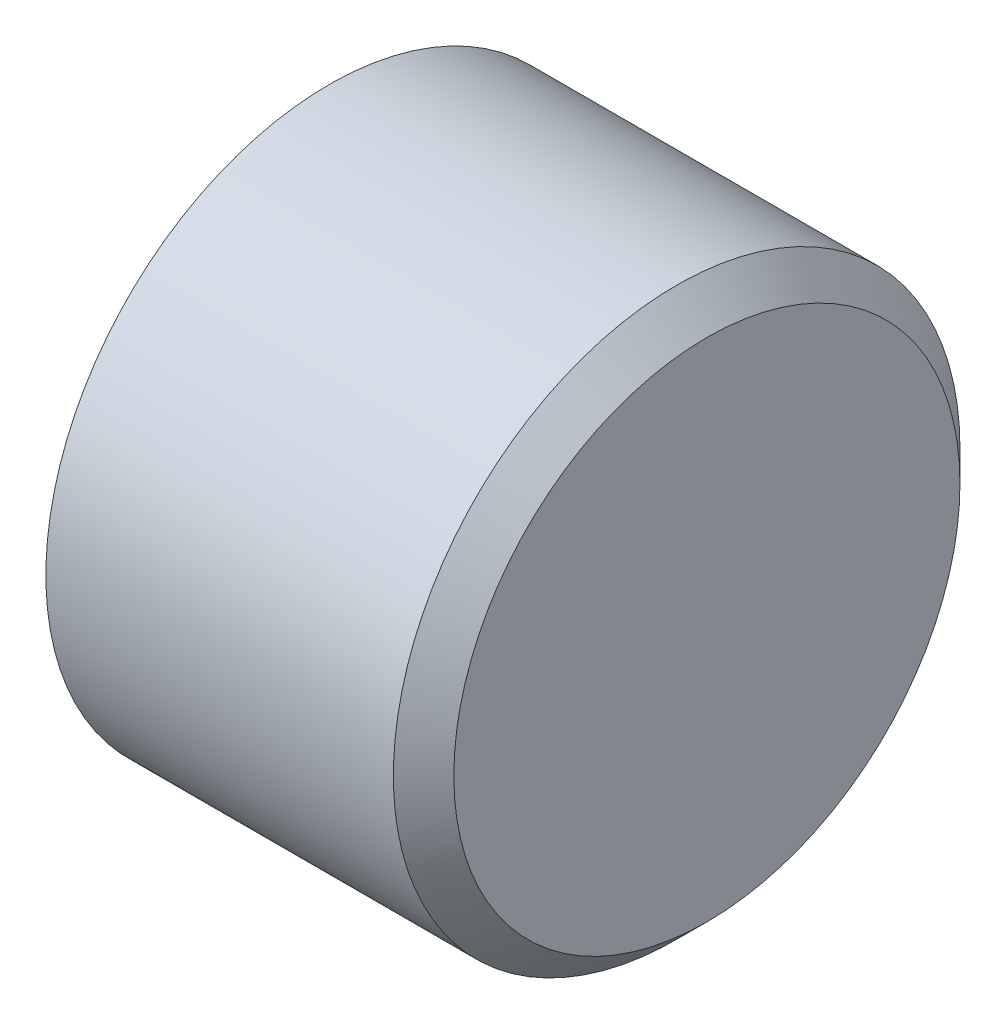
ISO-10303-21;
HEADER;
FILE_DESCRIPTION(('STEP AP214'),'2;1');
FILE_NAME('part.step','',(''),(''),'','','');
FILE_SCHEMA(('AUTOMOTIVE_DESIGN { 1 0 10303 214 1 1 1 1 }'));
ENDSEC;
DATA;
#1=APPLICATION_CONTEXT('core data for automotive mechanical design processes');
#2=APPLICATION_PROTOCOL_DEFINITION('international standard','automotive_design',2000,#1);
#3=PRODUCT_CONTEXT('',#1,'mechanical');
#4=PRODUCT('Part','Part','',(#3));
#5=PRODUCT_RELATED_PRODUCT_CATEGORY('part','',(#4));
#6=PRODUCT_DEFINITION_FORMATION('','',#4);
#7=PRODUCT_DEFINITION_CONTEXT('part definition',#1,'design');
#8=PRODUCT_DEFINITION('design','',#6,#7);
#9=PRODUCT_DEFINITION_SHAPE('','',#8);
#10=(LENGTH_UNIT() NAMED_UNIT(*) SI_UNIT(.MILLI.,.METRE.));
#11=(NAMED_UNIT(*) PLANE_ANGLE_UNIT() SI_UNIT($,.RADIAN.));
#12=(NAMED_UNIT(*) SI_UNIT($,.STERADIAN.) SOLID_ANGLE_UNIT());
#13=UNCERTAINTY_MEASURE_WITH_UNIT(LENGTH_MEASURE(1.E-05),#10,'distance_accuracy_value','');
#14=(GEOMETRIC_REPRESENTATION_CONTEXT(3) GLOBAL_UNCERTAINTY_ASSIGNED_CONTEXT((#13)) GLOBAL_UNIT_ASSIGNED_CONTEXT((#10,
#11,#12)) REPRESENTATION_CONTEXT('',''));
#15=CARTESIAN_POINT('',(0.,0.,0.));
#16=DIRECTION('',(0.,0.,1.));
#17=DIRECTION('',(1.,0.,0.));
#18=AXIS2_PLACEMENT_3D('',#15,#16,#17);
#19=CARTESIAN_POINT('',(0.,0.,0.));
#20=DIRECTION('',(1.,0.,0.));
#21=DIRECTION('',(0.,0.,-1.));
#22=AXIS2_PLACEMENT_3D('',#19,#20,#21);
#23=CYLINDRICAL_SURFACE('',#22,3.175);
#24=CARTESIAN_POINT('',(9.525,0.,0.));
#25=DIRECTION('',(1.,0.,0.));
#26=DIRECTION('',(0.,0.,-1.));
#27=AXIS2_PLACEMENT_3D('',#24,#25,#26);
#28=CIRCLE('',#27,3.175);
#29=CARTESIAN_POINT('',(9.525,0.,-3.175));
#30=VERTEX_POINT('',#29);
#31=EDGE_CURVE('E51',#30,#30,#28,.T.);
#32=ORIENTED_EDGE('',*,*,#31,.T.);
#33=EDGE_LOOP('',(#32));
#34=FACE_BOUND('',#33,.T.);
#35=CARTESIAN_POINT('',(0.,0.,0.));
#36=DIRECTION('',(1.,0.,0.));
#37=DIRECTION('',(0.,0.,-1.));
#38=AXIS2_PLACEMENT_3D('',#35,#36,#37);
#39=CIRCLE('',#38,3.175);
#40=CARTESIAN_POINT('',(0.,0.,-3.175));
#41=VERTEX_POINT('',#40);
#42=EDGE_CURVE('E42',#41,#41,#39,.T.);
#43=ORIENTED_EDGE('',*,*,#42,.F.);
#44=EDGE_LOOP('',(#43));
#45=FACE_BOUND('',#44,.T.);
#46=ADVANCED_FACE('F31',(#34,#45),#23,.F.);
#47=CARTESIAN_POINT('',(0.,3.175,0.));
#48=DIRECTION('',(-1.,0.,0.));
#49=DIRECTION('',(0.,0.,1.));
#50=AXIS2_PLACEMENT_3D('',#47,#48,#49);
#51=PLANE('',#50);
#52=ORIENTED_EDGE('',*,*,#42,.T.);
#53=EDGE_LOOP('',(#52));
#54=FACE_BOUND('',#53,.T.);
#55=CARTESIAN_POINT('',(0.,0.,0.));
#56=DIRECTION('',(1.,0.,0.));
#57=DIRECTION('',(0.,0.,-1.));
#58=AXIS2_PLACEMENT_3D('',#55,#56,#57);
#59=CIRCLE('',#58,9.525);
#60=CARTESIAN_POINT('',(0.,0.,-9.525));
#61=VERTEX_POINT('',#60);
#62=EDGE_CURVE('E46',#61,#61,#59,.T.);
#63=ORIENTED_EDGE('',*,*,#62,.F.);
#64=EDGE_LOOP('',(#63));
#65=FACE_BOUND('',#64,.T.);
#66=ADVANCED_FACE('F69',(#54,#65),#51,.T.);
#67=CARTESIAN_POINT('',(0.,0.,0.));
#68=DIRECTION('',(1.,0.,0.));
#69=DIRECTION('',(0.,0.,-1.));
#70=AXIS2_PLACEMENT_3D('',#67,#68,#69);
#71=CYLINDRICAL_SURFACE('',#70,9.525);
#72=CARTESIAN_POINT('',(11.684,0.,0.));
#73=DIRECTION('',(1.,0.,0.));
#74=DIRECTION('',(0.,0.,-1.));
#75=AXIS2_PLACEMENT_3D('',#72,#73,#74);
#76=CIRCLE('',#75,9.525);
#77=CARTESIAN_POINT('',(11.684,0.,-9.525));
#78=VERTEX_POINT('',#77);
#79=EDGE_CURVE('E10',#78,#78,#76,.F.);
#80=ORIENTED_EDGE('',*,*,#79,.T.);
#81=EDGE_LOOP('',(#80));
#82=FACE_BOUND('',#81,.T.);
#83=ORIENTED_EDGE('',*,*,#62,.T.);
#84=EDGE_LOOP('',(#83));
#85=FACE_BOUND('',#84,.T.);
#86=ADVANCED_FACE('F66',(#82,#85),#71,.T.);
#87=CARTESIAN_POINT('',(12.7,9.525,0.));
#88=DIRECTION('',(1.,0.,0.));
#89=DIRECTION('',(0.,0.,-1.));
#90=AXIS2_PLACEMENT_3D('',#87,#88,#89);
#91=PLANE('',#90);
#92=CARTESIAN_POINT('',(12.7,0.,0.));
#93=DIRECTION('',(1.,0.,0.));
#94=DIRECTION('',(0.,0.,-1.));
#95=AXIS2_PLACEMENT_3D('',#92,#93,#94);
#96=CIRCLE('',#95,8.509);
#97=CARTESIAN_POINT('',(12.7,0.,-8.509));
#98=VERTEX_POINT('',#97);
#99=EDGE_CURVE('E38',#98,#98,#96,.T.);
#100=ORIENTED_EDGE('',*,*,#99,.T.);
#101=EDGE_LOOP('',(#100));
#102=FACE_BOUND('',#101,.T.);
#103=ADVANCED_FACE('F59',(#102),#91,.T.);
#104=CARTESIAN_POINT('',(9.525,0.,0.));
#105=DIRECTION('',(-1.,0.,0.));
#106=DIRECTION('',(0.,0.,1.));
#107=AXIS2_PLACEMENT_3D('',#104,#105,#106);
#108=PLANE('',#107);
#109=ORIENTED_EDGE('',*,*,#31,.F.);
#110=EDGE_LOOP('',(#109));
#111=FACE_BOUND('',#110,.T.);
#112=ADVANCED_FACE('F57',(#111),#108,.T.);
#113=CARTESIAN_POINT('',(12.7,0.,0.));
#114=DIRECTION('',(-1.,0.,0.));
#115=DIRECTION('',(0.,0.,1.));
#116=AXIS2_PLACEMENT_3D('',#113,#114,#115);
#117=CONICAL_SURFACE('',#116,8.509,0.785398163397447);
#118=ORIENTED_EDGE('',*,*,#79,.F.);
#119=EDGE_LOOP('',(#118));
#120=FACE_BOUND('',#119,.T.);
#121=ORIENTED_EDGE('',*,*,#99,.F.);
#122=EDGE_LOOP('',(#121));
#123=FACE_BOUND('',#122,.T.);
#124=ADVANCED_FACE('F33',(#120,#123),#117,.T.);
#125=CLOSED_SHELL('',(#46,#66,#86,#103,#112,#124));
#126=MANIFOLD_SOLID_BREP('B2',#125);
#127=ADVANCED_BREP_SHAPE_REPRESENTATION('',(#18,#126),#14);
#128=SHAPE_DEFINITION_REPRESENTATION(#9,#127);
ENDSEC;
END-ISO-10303-21;
